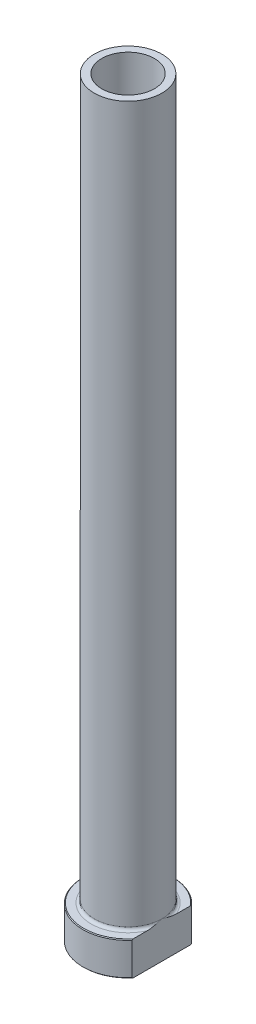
ISO-10303-21;
HEADER;
FILE_DESCRIPTION(('STEP AP214'),'2;1');
FILE_NAME('part.step','',(''),(''),'','','');
FILE_SCHEMA(('AUTOMOTIVE_DESIGN { 1 0 10303 214 1 1 1 1 }'));
ENDSEC;
DATA;
#1=APPLICATION_CONTEXT('core data for automotive mechanical design processes');
#2=APPLICATION_PROTOCOL_DEFINITION('international standard','automotive_design',2000,#1);
#3=PRODUCT_CONTEXT('',#1,'mechanical');
#4=PRODUCT('Part','Part','',(#3));
#5=PRODUCT_RELATED_PRODUCT_CATEGORY('part','',(#4));
#6=PRODUCT_DEFINITION_FORMATION('','',#4);
#7=PRODUCT_DEFINITION_CONTEXT('part definition',#1,'design');
#8=PRODUCT_DEFINITION('design','',#6,#7);
#9=PRODUCT_DEFINITION_SHAPE('','',#8);
#10=(LENGTH_UNIT() NAMED_UNIT(*) SI_UNIT(.MILLI.,.METRE.));
#11=(NAMED_UNIT(*) PLANE_ANGLE_UNIT() SI_UNIT($,.RADIAN.));
#12=(NAMED_UNIT(*) SI_UNIT($,.STERADIAN.) SOLID_ANGLE_UNIT());
#13=UNCERTAINTY_MEASURE_WITH_UNIT(LENGTH_MEASURE(1.E-05),#10,'distance_accuracy_value','');
#14=(GEOMETRIC_REPRESENTATION_CONTEXT(3) GLOBAL_UNCERTAINTY_ASSIGNED_CONTEXT((#13)) GLOBAL_UNIT_ASSIGNED_CONTEXT((#10,
#11,#12)) REPRESENTATION_CONTEXT('',''));
#15=CARTESIAN_POINT('',(0.,0.,0.));
#16=DIRECTION('',(0.,0.,1.));
#17=DIRECTION('',(1.,0.,0.));
#18=AXIS2_PLACEMENT_3D('',#15,#16,#17);
#19=CARTESIAN_POINT('',(0.,92.1876809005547,0.));
#20=DIRECTION('',(0.,1.,0.));
#21=DIRECTION('',(0.,0.,1.));
#22=AXIS2_PLACEMENT_3D('',#19,#20,#21);
#23=CYLINDRICAL_SURFACE('',#22,7.);
#24=CARTESIAN_POINT('',(0.,200.,0.));
#25=DIRECTION('',(0.,1.,0.));
#26=DIRECTION('',(0.,0.,1.));
#27=AXIS2_PLACEMENT_3D('',#24,#25,#26);
#28=CIRCLE('',#27,7.);
#29=CARTESIAN_POINT('',(0.,200.,7.));
#30=VERTEX_POINT('',#29);
#31=EDGE_CURVE('E167',#30,#30,#28,.T.);
#32=ORIENTED_EDGE('',*,*,#31,.T.);
#33=EDGE_LOOP('',(#32));
#34=FACE_BOUND('',#33,.T.);
#35=CARTESIAN_POINT('',(0.,145.,0.));
#36=DIRECTION('',(0.,1.,0.));
#37=DIRECTION('',(0.,0.,1.));
#38=AXIS2_PLACEMENT_3D('',#35,#36,#37);
#39=CIRCLE('',#38,7.);
#40=CARTESIAN_POINT('',(0.,145.,7.));
#41=VERTEX_POINT('',#40);
#42=EDGE_CURVE('E170',#41,#41,#39,.T.);
#43=ORIENTED_EDGE('',*,*,#42,.F.);
#44=EDGE_LOOP('',(#43));
#45=FACE_BOUND('',#44,.T.);
#46=ADVANCED_FACE('F32',(#34,#45),#23,.F.);
#47=CARTESIAN_POINT('',(-7.,200.,0.));
#48=DIRECTION('',(0.,1.,0.));
#49=DIRECTION('',(0.,0.,1.));
#50=AXIS2_PLACEMENT_3D('',#47,#48,#49);
#51=PLANE('',#50);
#52=CARTESIAN_POINT('',(0.,200.,0.));
#53=DIRECTION('',(0.,1.,0.));
#54=DIRECTION('',(0.,0.,1.));
#55=AXIS2_PLACEMENT_3D('',#52,#53,#54);
#56=CIRCLE('',#55,9.00000000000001);
#57=CARTESIAN_POINT('',(0.,200.,9.00000000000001));
#58=VERTEX_POINT('',#57);
#59=EDGE_CURVE('E174',#58,#58,#56,.T.);
#60=ORIENTED_EDGE('',*,*,#59,.T.);
#61=EDGE_LOOP('',(#60));
#62=FACE_BOUND('',#61,.T.);
#63=ORIENTED_EDGE('',*,*,#31,.F.);
#64=EDGE_LOOP('',(#63));
#65=FACE_BOUND('',#64,.T.);
#66=ADVANCED_FACE('F157',(#62,#65),#51,.T.);
#67=CARTESIAN_POINT('',(0.,92.1876809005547,0.));
#68=DIRECTION('',(0.,1.,0.));
#69=DIRECTION('',(0.,0.,1.));
#70=AXIS2_PLACEMENT_3D('',#67,#68,#69);
#71=CYLINDRICAL_SURFACE('',#70,9.);
#72=CARTESIAN_POINT('',(0.,9.8,0.));
#73=DIRECTION('',(0.,1.,0.));
#74=DIRECTION('',(0.,0.,1.));
#75=AXIS2_PLACEMENT_3D('',#72,#73,#74);
#76=CIRCLE('',#75,9.);
#77=CARTESIAN_POINT('',(9.,9.8,0.));
#78=VERTEX_POINT('',#77);
#79=EDGE_CURVE('E180',#78,#78,#76,.T.);
#80=ORIENTED_EDGE('',*,*,#79,.T.);
#81=EDGE_LOOP('',(#80));
#82=FACE_BOUND('',#81,.T.);
#83=ORIENTED_EDGE('',*,*,#59,.F.);
#84=EDGE_LOOP('',(#83));
#85=FACE_BOUND('',#84,.T.);
#86=ADVANCED_FACE('F162',(#82,#85),#71,.T.);
#87=CARTESIAN_POINT('',(-8.99999999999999,9.,0.));
#88=DIRECTION('',(0.,1.,0.));
#89=DIRECTION('',(0.,0.,1.));
#90=AXIS2_PLACEMENT_3D('',#87,#88,#89);
#91=PLANE('',#90);
#92=DIRECTION('',(0.,0.,1.));
#93=VECTOR('',#92,1.);
#94=CARTESIAN_POINT('',(9.,9.,0.));
#95=LINE('',#94,#93);
#96=CARTESIAN_POINT('',(9.,9.,-7.6315136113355));
#97=VERTEX_POINT('',#96);
#98=CARTESIAN_POINT('',(9.,9.,-3.87814388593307));
#99=VERTEX_POINT('',#98);
#100=EDGE_CURVE('E54',#97,#99,#95,.T.);
#101=ORIENTED_EDGE('',*,*,#100,.F.);
#102=CARTESIAN_POINT('',(0.,9.,0.));
#103=DIRECTION('',(0.,1.,0.));
#104=DIRECTION('',(0.,0.,1.));
#105=AXIS2_PLACEMENT_3D('',#102,#103,#104);
#106=CIRCLE('',#105,11.8);
#107=CARTESIAN_POINT('',(8.99999999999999,9.,7.63151361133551));
#108=VERTEX_POINT('',#107);
#109=EDGE_CURVE('E186',#97,#108,#106,.T.);
#110=ORIENTED_EDGE('',*,*,#109,.T.);
#111=CARTESIAN_POINT('',(9.,9.,3.87814388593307));
#112=VERTEX_POINT('',#111);
#113=EDGE_CURVE('E134',#112,#108,#95,.T.);
#114=ORIENTED_EDGE('',*,*,#113,.F.);
#115=CARTESIAN_POINT('',(0.,9.,0.));
#116=DIRECTION('',(0.,1.,0.));
#117=DIRECTION('',(0.,0.,1.));
#118=AXIS2_PLACEMENT_3D('',#115,#116,#117);
#119=CIRCLE('',#118,9.8);
#120=EDGE_CURVE('E183',#112,#99,#119,.F.);
#121=ORIENTED_EDGE('',*,*,#120,.T.);
#122=EDGE_LOOP('',(#101,#110,#114,#121));
#123=FACE_BOUND('',#122,.T.);
#124=ADVANCED_FACE('F197',(#123),#91,.T.);
#125=CARTESIAN_POINT('',(0.,92.1876809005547,0.));
#126=DIRECTION('',(0.,1.,0.));
#127=DIRECTION('',(0.,0.,1.));
#128=AXIS2_PLACEMENT_3D('',#125,#126,#127);
#129=CYLINDRICAL_SURFACE('',#128,12.);
#130=DIRECTION('',(0.,-1.,0.));
#131=VECTOR('',#130,1.);
#132=CARTESIAN_POINT('',(8.99999999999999,200.,7.93725393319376));
#133=LINE('',#132,#131);
#134=CARTESIAN_POINT('',(8.99999999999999,8.79999999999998,7.93725393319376));
#135=VERTEX_POINT('',#134);
#136=CARTESIAN_POINT('',(8.99999999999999,0.20000000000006,7.93725393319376));
#137=VERTEX_POINT('',#136);
#138=EDGE_CURVE('E82',#135,#137,#133,.T.);
#139=ORIENTED_EDGE('',*,*,#138,.F.);
#140=CARTESIAN_POINT('',(0.,8.79999999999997,0.));
#141=DIRECTION('',(0.,1.,0.));
#142=DIRECTION('',(0.,0.,1.));
#143=AXIS2_PLACEMENT_3D('',#140,#141,#142);
#144=CIRCLE('',#143,12.);
#145=CARTESIAN_POINT('',(9.,8.79999999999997,-7.93725393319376));
#146=VERTEX_POINT('',#145);
#147=EDGE_CURVE('E95',#135,#146,#144,.F.);
#148=ORIENTED_EDGE('',*,*,#147,.T.);
#149=DIRECTION('',(0.,-1.,0.));
#150=VECTOR('',#149,1.);
#151=CARTESIAN_POINT('',(9.,200.,-7.93725393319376));
#152=LINE('',#151,#150);
#153=CARTESIAN_POINT('',(9.,0.200000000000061,-7.93725393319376));
#154=VERTEX_POINT('',#153);
#155=EDGE_CURVE('E192',#146,#154,#152,.T.);
#156=ORIENTED_EDGE('',*,*,#155,.T.);
#157=CARTESIAN_POINT('',(0.,0.200000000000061,0.));
#158=DIRECTION('',(0.,-1.,0.));
#159=DIRECTION('',(0.,0.,-1.));
#160=AXIS2_PLACEMENT_3D('',#157,#158,#159);
#161=CIRCLE('',#160,12.);
#162=EDGE_CURVE('E98',#154,#137,#161,.F.);
#163=ORIENTED_EDGE('',*,*,#162,.T.);
#164=EDGE_LOOP('',(#139,#148,#156,#163));
#165=FACE_BOUND('',#164,.T.);
#166=ADVANCED_FACE('F190',(#165),#129,.T.);
#167=CARTESIAN_POINT('',(-12.,0.,0.));
#168=DIRECTION('',(0.,-1.,0.));
#169=DIRECTION('',(0.,0.,-1.));
#170=AXIS2_PLACEMENT_3D('',#167,#168,#169);
#171=PLANE('',#170);
#172=CARTESIAN_POINT('',(0.,0.,0.));
#173=DIRECTION('',(0.,-1.,0.));
#174=DIRECTION('',(0.,0.,-1.));
#175=AXIS2_PLACEMENT_3D('',#172,#173,#174);
#176=CIRCLE('',#175,7.74999999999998);
#177=CARTESIAN_POINT('',(0.,0.,-7.74999999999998));
#178=VERTEX_POINT('',#177);
#179=EDGE_CURVE('E40',#178,#178,#176,.F.);
#180=ORIENTED_EDGE('',*,*,#179,.T.);
#181=EDGE_LOOP('',(#180));
#182=FACE_BOUND('',#181,.T.);
#183=DIRECTION('',(0.,0.,-1.));
#184=VECTOR('',#183,1.);
#185=CARTESIAN_POINT('',(8.99999999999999,0.,7.93725393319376));
#186=LINE('',#185,#184);
#187=CARTESIAN_POINT('',(8.99999999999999,0.,7.6315136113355));
#188=VERTEX_POINT('',#187);
#189=CARTESIAN_POINT('',(9.,0.,-7.6315136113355));
#190=VERTEX_POINT('',#189);
#191=EDGE_CURVE('E47',#188,#190,#186,.T.);
#192=ORIENTED_EDGE('',*,*,#191,.F.);
#193=CARTESIAN_POINT('',(0.,0.,0.));
#194=DIRECTION('',(0.,-1.,0.));
#195=DIRECTION('',(0.,0.,-1.));
#196=AXIS2_PLACEMENT_3D('',#193,#194,#195);
#197=CIRCLE('',#196,11.8);
#198=EDGE_CURVE('E92',#188,#190,#197,.T.);
#199=ORIENTED_EDGE('',*,*,#198,.T.);
#200=EDGE_LOOP('',(#192,#199));
#201=FACE_BOUND('',#200,.T.);
#202=ADVANCED_FACE('F91',(#182,#201),#171,.T.);
#203=CARTESIAN_POINT('',(0.,92.1876809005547,0.));
#204=DIRECTION('',(0.,1.,0.));
#205=DIRECTION('',(0.,0.,1.));
#206=AXIS2_PLACEMENT_3D('',#203,#204,#205);
#207=CYLINDRICAL_SURFACE('',#206,7.25);
#208=CARTESIAN_POINT('',(0.,0.499999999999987,0.));
#209=DIRECTION('',(0.,-1.,0.));
#210=DIRECTION('',(0.,0.,-1.));
#211=AXIS2_PLACEMENT_3D('',#208,#209,#210);
#212=CIRCLE('',#211,7.25);
#213=CARTESIAN_POINT('',(0.,0.499999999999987,-7.25));
#214=VERTEX_POINT('',#213);
#215=EDGE_CURVE('E11',#214,#214,#212,.T.);
#216=ORIENTED_EDGE('',*,*,#215,.T.);
#217=EDGE_LOOP('',(#216));
#218=FACE_BOUND('',#217,.T.);
#219=CARTESIAN_POINT('',(0.,133.,0.));
#220=DIRECTION('',(0.,1.,0.));
#221=DIRECTION('',(0.,0.,1.));
#222=AXIS2_PLACEMENT_3D('',#219,#220,#221);
#223=CIRCLE('',#222,7.25000000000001);
#224=CARTESIAN_POINT('',(0.,133.,7.25000000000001));
#225=VERTEX_POINT('',#224);
#226=EDGE_CURVE('E172',#225,#225,#223,.T.);
#227=ORIENTED_EDGE('',*,*,#226,.T.);
#228=EDGE_LOOP('',(#227));
#229=FACE_BOUND('',#228,.T.);
#230=ADVANCED_FACE('F215',(#218,#229),#207,.F.);
#231=CARTESIAN_POINT('',(0.,133.,0.));
#232=DIRECTION('',(0.,-1.,0.));
#233=DIRECTION('',(0.,0.,-1.));
#234=AXIS2_PLACEMENT_3D('',#231,#232,#233);
#235=CONICAL_SURFACE('',#234,7.25000000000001,0.0208303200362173);
#236=ORIENTED_EDGE('',*,*,#42,.T.);
#237=EDGE_LOOP('',(#236));
#238=FACE_BOUND('',#237,.T.);
#239=ORIENTED_EDGE('',*,*,#226,.F.);
#240=EDGE_LOOP('',(#239));
#241=FACE_BOUND('',#240,.T.);
#242=ADVANCED_FACE('F111',(#238,#241),#235,.F.);
#243=CARTESIAN_POINT('',(0.,9.8,0.));
#244=DIRECTION('',(0.,1.,0.));
#245=DIRECTION('',(0.,0.,1.));
#246=AXIS2_PLACEMENT_3D('',#243,#244,#245);
#247=TOROIDAL_SURFACE('',#246,9.8,0.8);
#248=ORIENTED_EDGE('',*,*,#120,.F.);
#249=CARTESIAN_POINT('',(9.,9.8,0.));
#250=CARTESIAN_POINT('',(9.,9.80000101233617,-6.46837226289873E-11));
#251=CARTESIAN_POINT('',(9.,9.80000202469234,3.1733241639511E-07));
#252=CARTESIAN_POINT('',(9.,9.80000393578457,1.24154711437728E-06));
#253=CARTESIAN_POINT('',(9.,9.80000482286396,1.86583013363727E-06));
#254=CARTESIAN_POINT('',(9.,9.80000663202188,3.35641272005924E-06));
#255=CARTESIAN_POINT('',(9.,9.80000753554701,4.245673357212E-06));
#256=CARTESIAN_POINT('',(9.,9.80000918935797,6.11612133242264E-06));
#257=CARTESIAN_POINT('',(9.,9.80000994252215,7.09491962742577E-06));
#258=CARTESIAN_POINT('',(9.,9.80001263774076,1.07802695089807E-05));
#259=CARTESIAN_POINT('',(9.,9.80001442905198,1.36008580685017E-05));
#260=CARTESIAN_POINT('',(9.,9.80001746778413,1.9272252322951E-05));
#261=CARTESIAN_POINT('',(9.,9.80001874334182,2.2108720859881E-05));
#262=CARTESIAN_POINT('',(9.,9.80002390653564,3.37975021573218E-05));
#263=CARTESIAN_POINT('',(9.,9.80002763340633,4.27293144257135E-05));
#264=CARTESIAN_POINT('',(9.,9.80003330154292,5.98324777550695E-05));
#265=CARTESIAN_POINT('',(9.,9.80003541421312,6.79472930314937E-05));
#266=CARTESIAN_POINT('',(9.,9.80005049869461,0.000127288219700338));
#267=CARTESIAN_POINT('',(9.,9.80006163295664,0.000178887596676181));
#268=CARTESIAN_POINT('',(8.99999999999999,9.80011034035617,0.000381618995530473));
#269=CARTESIAN_POINT('',(9.,9.80015710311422,0.000530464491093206));
#270=CARTESIAN_POINT('',(9.,9.80033804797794,0.0011172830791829));
#271=CARTESIAN_POINT('',(9.,9.80046603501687,0.00155660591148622));
#272=CARTESIAN_POINT('',(8.99999999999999,9.80097635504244,0.003294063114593));
#273=CARTESIAN_POINT('',(8.99999999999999,9.80136631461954,0.00459050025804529));
#274=CARTESIAN_POINT('',(9.,9.80298403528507,0.00998416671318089));
#275=CARTESIAN_POINT('',(9.,9.80420236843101,0.0140834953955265));
#276=CARTESIAN_POINT('',(8.99999999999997,9.82648661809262,0.089042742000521));
#277=CARTESIAN_POINT('',(8.99999999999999,9.84764626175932,0.159882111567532));
#278=CARTESIAN_POINT('',(9.,9.8889590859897,0.298764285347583));
#279=CARTESIAN_POINT('',(9.,9.90911860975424,0.366805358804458));
#280=CARTESIAN_POINT('',(8.99999999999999,9.95179311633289,0.511524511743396));
#281=CARTESIAN_POINT('',(9.,9.97428452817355,0.588209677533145));
#282=CARTESIAN_POINT('',(9.,10.0191408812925,0.742532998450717));
#283=CARTESIAN_POINT('',(9.,10.0415017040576,0.820172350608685));
#284=CARTESIAN_POINT('',(9.,10.079411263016,0.953448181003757));
#285=CARTESIAN_POINT('',(9.,10.0950851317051,1.00904901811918));
#286=CARTESIAN_POINT('',(9.,10.1260784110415,1.12019530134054));
#287=CARTESIAN_POINT('',(9.,10.1413986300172,1.17574052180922));
#288=CARTESIAN_POINT('',(9.,10.1860703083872,1.33980716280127));
#289=CARTESIAN_POINT('',(9.,10.2149083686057,1.44846861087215));
#290=CARTESIAN_POINT('',(9.,10.2856369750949,1.72417832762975));
#291=CARTESIAN_POINT('',(9.,10.3263124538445,1.89154391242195));
#292=CARTESIAN_POINT('',(9.,10.4020454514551,2.22904779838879));
#293=CARTESIAN_POINT('',(9.,10.4370523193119,2.39919757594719));
#294=CARTESIAN_POINT('',(9.,10.5014391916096,2.75494052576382));
#295=CARTESIAN_POINT('',(9.,10.5301301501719,2.94066439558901));
#296=CARTESIAN_POINT('',(9.,10.5633122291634,3.22016202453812));
#297=CARTESIAN_POINT('',(9.,10.5727244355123,3.31335338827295));
#298=CARTESIAN_POINT('',(9.,10.5877042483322,3.50003892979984));
#299=CARTESIAN_POINT('',(9.,10.5932725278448,3.59353305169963));
#300=CARTESIAN_POINT('',(9.,10.5997812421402,3.77831079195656));
#301=CARTESIAN_POINT('',(9.,10.6008358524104,3.8695901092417));
#302=CARTESIAN_POINT('',(9.,10.5977997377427,4.05215299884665));
#303=CARTESIAN_POINT('',(8.99999999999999,10.5937049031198,4.14343651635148));
#304=CARTESIAN_POINT('',(8.99999999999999,10.5793848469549,4.32415905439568));
#305=CARTESIAN_POINT('',(8.99999999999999,10.5692536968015,4.41360502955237));
#306=CARTESIAN_POINT('',(8.99999999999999,10.5415393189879,4.59125765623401));
#307=CARTESIAN_POINT('',(8.99999999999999,10.5239649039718,4.67946564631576));
#308=CARTESIAN_POINT('',(8.99999999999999,10.4790565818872,4.85471882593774));
#309=CARTESIAN_POINT('',(8.99999999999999,10.4516029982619,4.94173554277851));
#310=CARTESIAN_POINT('',(8.99999999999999,10.4007972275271,5.06830195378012));
#311=CARTESIAN_POINT('',(8.99999999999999,10.3822808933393,5.1097917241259));
#312=CARTESIAN_POINT('',(8.99999999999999,10.3414775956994,5.19085457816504));
#313=CARTESIAN_POINT('',(8.99999999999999,10.3191952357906,5.23042992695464));
#314=CARTESIAN_POINT('',(8.99999999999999,10.2750362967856,5.29920261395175));
#315=CARTESIAN_POINT('',(8.99999999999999,10.2539514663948,5.32890420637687));
#316=CARTESIAN_POINT('',(8.99999999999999,10.2085010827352,5.38577147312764));
#317=CARTESIAN_POINT('',(8.99999999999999,10.1841327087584,5.41293493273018));
#318=CARTESIAN_POINT('',(8.99999999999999,10.1314615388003,5.46389233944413));
#319=CARTESIAN_POINT('',(8.99999999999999,10.1031152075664,5.48764214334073));
#320=CARTESIAN_POINT('',(8.99999999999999,10.04261248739,5.52966859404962));
#321=CARTESIAN_POINT('',(8.99999999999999,10.0104678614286,5.54796155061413));
#322=CARTESIAN_POINT('',(8.99999999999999,9.95377518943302,5.57238639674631));
#323=CARTESIAN_POINT('',(8.99999999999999,9.93009823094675,5.58053697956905));
#324=CARTESIAN_POINT('',(8.99999999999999,9.88171464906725,5.59278453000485));
#325=CARTESIAN_POINT('',(8.99999999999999,9.85700894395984,5.59688503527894));
#326=CARTESIAN_POINT('',(8.99999999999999,9.80717489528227,5.60067699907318));
#327=CARTESIAN_POINT('',(8.99999999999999,9.78204544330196,5.60035415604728));
#328=CARTESIAN_POINT('',(8.99999999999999,9.73223420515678,5.59529565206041));
#329=CARTESIAN_POINT('',(8.99999999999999,9.7075525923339,5.5905583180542));
#330=CARTESIAN_POINT('',(8.99999999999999,9.66020362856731,5.57733425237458));
#331=CARTESIAN_POINT('',(8.99999999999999,9.63749568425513,5.56898983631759));
#332=CARTESIAN_POINT('',(8.99999999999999,9.5935151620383,5.54915687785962));
#333=CARTESIAN_POINT('',(8.99999999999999,9.57224307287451,5.5376672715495));
#334=CARTESIAN_POINT('',(8.99999999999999,9.51928150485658,5.50462580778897));
#335=CARTESIAN_POINT('',(8.99999999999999,9.48880776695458,5.4811266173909));
#336=CARTESIAN_POINT('',(8.99999999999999,9.43189052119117,5.42965338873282));
#337=CARTESIAN_POINT('',(8.99999999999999,9.40546009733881,5.40166539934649));
#338=CARTESIAN_POINT('',(8.99999999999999,9.34005551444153,5.32319042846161));
#339=CARTESIAN_POINT('',(8.99999999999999,9.3043047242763,5.27003866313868));
#340=CARTESIAN_POINT('',(8.99999999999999,9.24095813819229,5.15926391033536));
#341=CARTESIAN_POINT('',(8.99999999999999,9.21336826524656,5.10163771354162));
#342=CARTESIAN_POINT('',(8.99999999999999,9.16551403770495,4.98579619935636));
#343=CARTESIAN_POINT('',(8.99999999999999,9.14502939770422,4.92767012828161));
#344=CARTESIAN_POINT('',(8.99999999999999,9.10900516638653,4.80987690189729));
#345=CARTESIAN_POINT('',(8.99999999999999,9.09347054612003,4.75020826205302));
#346=CARTESIAN_POINT('',(8.99999999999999,9.06639912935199,4.6292635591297));
#347=CARTESIAN_POINT('',(8.99999999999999,9.05491059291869,4.56797688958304));
#348=CARTESIAN_POINT('',(8.99999999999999,9.0355498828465,4.44488746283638));
#349=CARTESIAN_POINT('',(8.99999999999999,9.02767548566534,4.38308504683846));
#350=CARTESIAN_POINT('',(8.99999999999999,9.01237706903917,4.23320098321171));
#351=CARTESIAN_POINT('',(8.99999999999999,9.00652460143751,4.14495990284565));
#352=CARTESIAN_POINT('',(8.99999999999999,8.99996624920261,3.96827125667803));
#353=CARTESIAN_POINT('',(9.,8.99926276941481,3.87982361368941));
#354=CARTESIAN_POINT('',(9.,9.00218728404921,3.70272096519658));
#355=CARTESIAN_POINT('',(9.,9.00582939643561,3.61406622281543));
#356=CARTESIAN_POINT('',(9.,9.01681466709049,3.43698088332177));
#357=CARTESIAN_POINT('',(9.,9.02415848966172,3.34855032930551));
#358=CARTESIAN_POINT('',(9.,9.04989749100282,3.09391807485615));
#359=CARTESIAN_POINT('',(9.,9.0723219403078,2.92812217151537));
#360=CARTESIAN_POINT('',(9.,9.12539895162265,2.59921508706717));
#361=CARTESIAN_POINT('',(9.,9.15598725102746,2.43609307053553));
#362=CARTESIAN_POINT('',(9.,9.22330285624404,2.11182788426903));
#363=CARTESIAN_POINT('',(9.,9.26000471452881,1.95067936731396));
#364=CARTESIAN_POINT('',(9.,9.31897632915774,1.70786584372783));
#365=CARTESIAN_POINT('',(9.,9.33955107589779,1.62578051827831));
#366=CARTESIAN_POINT('',(9.,9.38177259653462,1.46165638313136));
#367=CARTESIAN_POINT('',(9.,9.4034220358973,1.37961825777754));
#368=CARTESIAN_POINT('',(9.,9.45602430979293,1.18435079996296));
#369=CARTESIAN_POINT('',(9.,9.48736095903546,1.07122519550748));
#370=CARTESIAN_POINT('',(9.,9.55083956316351,0.846545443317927));
#371=CARTESIAN_POINT('',(9.,9.58296886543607,0.734987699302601));
#372=CARTESIAN_POINT('',(8.99999999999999,9.64431039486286,0.524609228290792));
#373=CARTESIAN_POINT('',(8.99999999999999,9.67344475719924,0.425765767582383));
#374=CARTESIAN_POINT('',(9.,9.71808680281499,0.275077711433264));
#375=CARTESIAN_POINT('',(9.,9.73349584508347,0.223203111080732));
#376=CARTESIAN_POINT('',(8.99999999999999,9.76415269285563,0.120285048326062));
#377=CARTESIAN_POINT('',(8.99999999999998,9.7793992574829,0.0692412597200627));
#378=CARTESIAN_POINT('',(9.,9.79579831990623,0.0140813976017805));
#379=CARTESIAN_POINT('',(9.,9.7970172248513,0.00997994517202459));
#380=CARTESIAN_POINT('',(8.99999999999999,9.79863508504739,0.00458578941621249));
#381=CARTESIAN_POINT('',(8.99999999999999,9.79902455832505,0.00329097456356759));
#382=CARTESIAN_POINT('',(9.,9.79953428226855,0.00155554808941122));
#383=CARTESIAN_POINT('',(9.,9.79966215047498,0.00111663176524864));
#384=CARTESIAN_POINT('',(9.,9.79984295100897,0.000530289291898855));
#385=CARTESIAN_POINT('',(8.99999999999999,9.79988969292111,0.000381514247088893));
#386=CARTESIAN_POINT('',(9.,9.79993838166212,0.000178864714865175));
#387=CARTESIAN_POINT('',(9.,9.79994951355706,0.000127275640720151));
#388=CARTESIAN_POINT('',(9.,9.79996459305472,6.79451326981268E-05));
#389=CARTESIAN_POINT('',(9.,9.79996670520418,5.98309285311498E-05));
#390=CARTESIAN_POINT('',(9.,9.79997237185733,4.27289821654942E-05));
#391=CARTESIAN_POINT('',(9.,9.79997609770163,3.37977439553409E-05));
#392=CARTESIAN_POINT('',(9.,9.79998125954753,2.21095447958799E-05));
#393=CARTESIAN_POINT('',(9.,9.79998253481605,1.92731218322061E-05));
#394=CARTESIAN_POINT('',(9.,9.79998557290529,1.36017677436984E-05));
#395=CARTESIAN_POINT('',(9.,9.79998736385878,1.07811687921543E-05));
#396=CARTESIAN_POINT('',(9.,9.79999005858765,7.09574455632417E-06));
#397=CARTESIAN_POINT('',(9.,9.79999081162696,6.11691132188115E-06));
#398=CARTESIAN_POINT('',(9.,9.79999246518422,4.24637095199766E-06));
#399=CARTESIAN_POINT('',(9.,9.79999336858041,3.35705227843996E-06));
#400=CARTESIAN_POINT('',(9.,9.79999517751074,1.86633170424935E-06));
#401=CARTESIAN_POINT('',(9.,9.79999606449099,1.24197318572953E-06));
#402=CARTESIAN_POINT('',(9.,9.79999797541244,3.1757083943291E-07));
#403=CARTESIAN_POINT('',(9.,9.79999898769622,6.46855868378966E-11));
#404=CARTESIAN_POINT('',(9.,9.8,0.));
#405=B_SPLINE_CURVE_WITH_KNOTS('',3,(#249,#250,#251,#252,#253,#254,#255,#256,#257,#258,#259,
#260,#261,#262,#263,#264,#265,#266,#267,#268,#269,#270,#271,#272,#273,#274,#275,#276,#277,#278,
#279,#280,#281,#282,#283,#284,#285,#286,#287,#288,#289,#290,#291,#292,#293,#294,#295,#296,#297,
#298,#299,#300,#301,#302,#303,#304,#305,#306,#307,#308,#309,#310,#311,#312,#313,#314,#315,#316,
#317,#318,#319,#320,#321,#322,#323,#324,#325,#326,#327,#328,#329,#330,#331,#332,#333,#334,#335,
#336,#337,#338,#339,#340,#341,#342,#343,#344,#345,#346,#347,#348,#349,#350,#351,#352,#353,#354,
#355,#356,#357,#358,#359,#360,#361,#362,#363,#364,#365,#366,#367,#368,#369,#370,#371,#372,#373,
#374,#375,#376,#377,#378,#379,#380,#381,#382,#383,#384,#385,#386,#387,#388,#389,#390,#391,#392,
#393,#394,#395,#396,#397,#398,#399,#400,#401,#402,#403,#404),.UNSPECIFIED.,.T.,.F.,(4,2,2,2,2,2,
2,2,2,2,2,2,2,2,2,2,2,2,2,2,2,2,2,2,2,2,2,2,2,2,2,2,2,2,2,2,2,2,2,2,2,2,2,2,2,2,2,2,2,2,2,2,2,2,
2,2,2,2,2,2,2,2,2,2,2,2,2,2,2,2,2,2,2,2,2,2,2,4),(0.,3.0477175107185E-06,6.29346410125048E-06,
1.0076989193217E-05,1.377912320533E-05,2.37619394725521E-05,3.30844939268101E-05,
6.20552070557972E-05,8.71785192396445E-05,0.000245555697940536,0.000713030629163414,
0.00208637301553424,0.00614710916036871,0.0189775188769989,0.240764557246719,0.453660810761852,
0.693405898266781,0.935790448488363,1.10909318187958,1.28194996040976,1.619210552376,
2.13583880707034,2.65685508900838,3.22023907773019,3.5011731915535,3.78205810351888,
4.05579427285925,4.32974904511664,4.5995421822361,4.8690167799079,5.14187221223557,
5.27802968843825,5.41402191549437,5.52311134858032,5.63229509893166,5.74278355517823,
5.85293838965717,5.92775570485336,6.00250761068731,6.07750126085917,6.15252334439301,
6.2248226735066,6.29714648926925,6.4119295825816,6.52707659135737,6.7181646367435,
6.90939103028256,7.09400621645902,7.27880622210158,7.46574121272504,7.65256103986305,
7.91766914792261,8.18290106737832,8.4489970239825,8.71514075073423,9.21672782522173,
9.71447745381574,10.2102047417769,10.4640739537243,10.7186077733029,11.0707555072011,
11.4190290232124,11.7281703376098,11.8905163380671,12.0503265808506,12.0631635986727,
12.0672192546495,12.068591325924,12.0690585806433,12.0692169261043,12.0692420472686,
12.0692710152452,12.0692803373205,12.0692903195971,12.0692940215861,12.0692978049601,
12.0693010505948,12.0693040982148),.UNSPECIFIED.);
#406=EDGE_CURVE('E126',#112,#78,#405,.T.);
#407=ORIENTED_EDGE('',*,*,#406,.T.);
#408=ORIENTED_EDGE('',*,*,#79,.F.);
#409=CARTESIAN_POINT('',(9.,9.8,0.));
#410=CARTESIAN_POINT('',(9.,9.79999898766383,6.46880328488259E-11));
#411=CARTESIAN_POINT('',(9.,9.79999797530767,-3.17332412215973E-07));
#412=CARTESIAN_POINT('',(9.,9.79999606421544,-1.24154711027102E-06));
#413=CARTESIAN_POINT('',(9.,9.79999517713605,-1.86583012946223E-06));
#414=CARTESIAN_POINT('',(9.,9.79999336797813,-3.35641271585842E-06));
#415=CARTESIAN_POINT('',(9.,9.799992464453,-4.24567335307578E-06));
#416=CARTESIAN_POINT('',(9.,9.79999081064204,-6.11612132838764E-06));
#417=CARTESIAN_POINT('',(9.,9.79999005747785,-7.09491962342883E-06));
#418=CARTESIAN_POINT('',(9.,9.79998736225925,-1.07802695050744E-05));
#419=CARTESIAN_POINT('',(9.,9.79998557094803,-1.36008580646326E-05));
#420=CARTESIAN_POINT('',(9.,9.79998253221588,-1.92722523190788E-05));
#421=CARTESIAN_POINT('',(9.,9.79998125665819,-2.21087208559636E-05));
#422=CARTESIAN_POINT('',(9.,9.79997609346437,-3.37975021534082E-05));
#423=CARTESIAN_POINT('',(9.,9.79997236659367,-4.27293144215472E-05));
#424=CARTESIAN_POINT('',(9.,9.79996669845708,-5.98324777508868E-05));
#425=CARTESIAN_POINT('',(9.,9.79996458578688,-6.79472930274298E-05));
#426=CARTESIAN_POINT('',(9.,9.7999495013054,-0.000127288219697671));
#427=CARTESIAN_POINT('',(9.,9.79993836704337,-0.000178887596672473));
#428=CARTESIAN_POINT('',(8.99999999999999,9.79988965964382,-0.00038161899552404));
#429=CARTESIAN_POINT('',(9.,9.79984289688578,-0.000530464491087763));
#430=CARTESIAN_POINT('',(9.,9.79966195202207,-0.00111728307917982));
#431=CARTESIAN_POINT('',(9.,9.79953396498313,-0.00155660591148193));
#432=CARTESIAN_POINT('',(8.99999999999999,9.79902364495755,-0.00329406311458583));
#433=CARTESIAN_POINT('',(8.99999999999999,9.79863368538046,-0.00459050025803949));
#434=CARTESIAN_POINT('',(9.,9.79701596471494,-0.00998416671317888));
#435=CARTESIAN_POINT('',(9.,9.79579763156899,-0.0140834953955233));
#436=CARTESIAN_POINT('',(8.99999999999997,9.77351338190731,-0.0890427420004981));
#437=CARTESIAN_POINT('',(8.99999999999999,9.75235373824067,-0.159882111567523));
#438=CARTESIAN_POINT('',(9.,9.71104091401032,-0.298764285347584));
#439=CARTESIAN_POINT('',(9.,9.69088139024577,-0.366805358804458));
#440=CARTESIAN_POINT('',(8.99999999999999,9.64820688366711,-0.511524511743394));
#441=CARTESIAN_POINT('',(9.,9.62571547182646,-0.588209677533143));
#442=CARTESIAN_POINT('',(9.,9.5808591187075,-0.742532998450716));
#443=CARTESIAN_POINT('',(9.,9.55849829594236,-0.820172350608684));
#444=CARTESIAN_POINT('',(9.,9.52058873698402,-0.953448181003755));
#445=CARTESIAN_POINT('',(9.,9.50491486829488,-1.00904901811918));
#446=CARTESIAN_POINT('',(9.,9.47392158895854,-1.12019530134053));
#447=CARTESIAN_POINT('',(9.,9.45860136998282,-1.17574052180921));
#448=CARTESIAN_POINT('',(9.,9.41392969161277,-1.33980716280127));
#449=CARTESIAN_POINT('',(9.,9.38509163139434,-1.44846861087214));
#450=CARTESIAN_POINT('',(9.,9.31436302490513,-1.72417832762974));
#451=CARTESIAN_POINT('',(9.,9.27368754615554,-1.89154391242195));
#452=CARTESIAN_POINT('',(9.,9.19795454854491,-2.22904779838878));
#453=CARTESIAN_POINT('',(9.,9.16294768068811,-2.39919757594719));
#454=CARTESIAN_POINT('',(9.,9.09856080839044,-2.75494052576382));
#455=CARTESIAN_POINT('',(9.,9.06986984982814,-2.940664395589));
#456=CARTESIAN_POINT('',(9.,9.03668777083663,-3.22016202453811));
#457=CARTESIAN_POINT('',(9.,9.0272755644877,-3.31335338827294));
#458=CARTESIAN_POINT('',(9.,9.01229575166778,-3.50003892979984));
#459=CARTESIAN_POINT('',(9.,9.00672747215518,-3.59353305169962));
#460=CARTESIAN_POINT('',(9.,9.00021875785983,-3.77831079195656));
#461=CARTESIAN_POINT('',(9.,8.99916414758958,-3.8695901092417));
#462=CARTESIAN_POINT('',(9.,9.00220026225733,-4.05215299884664));
#463=CARTESIAN_POINT('',(9.,9.00629509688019,-4.14343651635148));
#464=CARTESIAN_POINT('',(9.,9.02061515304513,-4.32415905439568));
#465=CARTESIAN_POINT('',(9.,9.03074630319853,-4.41360502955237));
#466=CARTESIAN_POINT('',(9.,9.05846068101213,-4.59125765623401));
#467=CARTESIAN_POINT('',(9.,9.0760350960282,-4.67946564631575));
#468=CARTESIAN_POINT('',(9.,9.12094341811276,-4.85471882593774));
#469=CARTESIAN_POINT('',(9.,9.14839700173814,-4.9417355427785));
#470=CARTESIAN_POINT('',(9.,9.19920277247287,-5.06830195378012));
#471=CARTESIAN_POINT('',(9.,9.2177191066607,-5.1097917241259));
#472=CARTESIAN_POINT('',(9.,9.25852240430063,-5.19085457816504));
#473=CARTESIAN_POINT('',(9.,9.28080476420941,-5.23042992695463));
#474=CARTESIAN_POINT('',(9.,9.32496370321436,-5.29920261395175));
#475=CARTESIAN_POINT('',(9.,9.34604853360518,-5.32890420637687));
#476=CARTESIAN_POINT('',(9.,9.39149891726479,-5.38577147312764));
#477=CARTESIAN_POINT('',(9.,9.41586729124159,-5.41293493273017));
#478=CARTESIAN_POINT('',(9.,9.46853846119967,-5.46389233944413));
#479=CARTESIAN_POINT('',(9.,9.49688479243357,-5.48764214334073));
#480=CARTESIAN_POINT('',(9.,9.55738751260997,-5.52966859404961));
#481=CARTESIAN_POINT('',(9.,9.58953213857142,-5.54796155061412));
#482=CARTESIAN_POINT('',(9.,9.64622481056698,-5.5723863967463));
#483=CARTESIAN_POINT('',(9.,9.66990176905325,-5.58053697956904));
#484=CARTESIAN_POINT('',(9.,9.71828535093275,-5.59278453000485));
#485=CARTESIAN_POINT('',(9.,9.74299105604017,-5.59688503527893));
#486=CARTESIAN_POINT('',(9.,9.79282510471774,-5.60067699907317));
#487=CARTESIAN_POINT('',(9.,9.81795455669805,-5.60035415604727));
#488=CARTESIAN_POINT('',(9.,9.86776579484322,-5.59529565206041));
#489=CARTESIAN_POINT('',(9.,9.89244740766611,-5.5905583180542));
#490=CARTESIAN_POINT('',(9.,9.93979637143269,-5.57733425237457));
#491=CARTESIAN_POINT('',(9.,9.96250431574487,-5.56898983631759));
#492=CARTESIAN_POINT('',(9.,10.0064848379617,-5.54915687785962));
#493=CARTESIAN_POINT('',(9.,10.0277569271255,-5.5376672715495));
#494=CARTESIAN_POINT('',(9.,10.0807184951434,-5.50462580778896));
#495=CARTESIAN_POINT('',(9.,10.1111922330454,-5.4811266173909));
#496=CARTESIAN_POINT('',(9.,10.1681094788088,-5.42965338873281));
#497=CARTESIAN_POINT('',(9.,10.1945399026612,-5.40166539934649));
#498=CARTESIAN_POINT('',(9.,10.2599444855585,-5.3231904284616));
#499=CARTESIAN_POINT('',(9.,10.2956952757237,-5.27003866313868));
#500=CARTESIAN_POINT('',(9.,10.3590418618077,-5.15926391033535));
#501=CARTESIAN_POINT('',(9.,10.3866317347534,-5.10163771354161));
#502=CARTESIAN_POINT('',(9.,10.4344859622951,-4.98579619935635));
#503=CARTESIAN_POINT('',(9.,10.4549706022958,-4.9276701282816));
#504=CARTESIAN_POINT('',(9.,10.4909948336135,-4.80987690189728));
#505=CARTESIAN_POINT('',(9.,10.50652945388,-4.75020826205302));
#506=CARTESIAN_POINT('',(9.,10.533600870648,-4.62926355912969));
#507=CARTESIAN_POINT('',(9.,10.5450894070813,-4.56797688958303));
#508=CARTESIAN_POINT('',(9.,10.5644501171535,-4.44488746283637));
#509=CARTESIAN_POINT('',(9.,10.5723245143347,-4.38308504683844));
#510=CARTESIAN_POINT('',(9.,10.5876229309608,-4.2332009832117));
#511=CARTESIAN_POINT('',(9.,10.5934753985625,-4.14495990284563));
#512=CARTESIAN_POINT('',(9.,10.6000337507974,-3.96827125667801));
#513=CARTESIAN_POINT('',(9.,10.6007372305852,-3.8798236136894));
#514=CARTESIAN_POINT('',(9.,10.5978127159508,-3.70272096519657));
#515=CARTESIAN_POINT('',(9.,10.5941706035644,-3.61406622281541));
#516=CARTESIAN_POINT('',(9.,10.5831853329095,-3.43698088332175));
#517=CARTESIAN_POINT('',(9.,10.5758415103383,-3.3485503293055));
#518=CARTESIAN_POINT('',(9.,10.5501025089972,-3.09391807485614));
#519=CARTESIAN_POINT('',(9.,10.5276780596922,-2.92812217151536));
#520=CARTESIAN_POINT('',(9.,10.4746010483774,-2.59921508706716));
#521=CARTESIAN_POINT('',(9.,10.4440127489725,-2.43609307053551));
#522=CARTESIAN_POINT('',(9.,10.376697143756,-2.11182788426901));
#523=CARTESIAN_POINT('',(9.,10.3399952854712,-1.95067936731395));
#524=CARTESIAN_POINT('',(9.,10.2810236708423,-1.70786584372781));
#525=CARTESIAN_POINT('',(9.,10.2604489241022,-1.62578051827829));
#526=CARTESIAN_POINT('',(9.,10.2182274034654,-1.46165638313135));
#527=CARTESIAN_POINT('',(9.,10.1965779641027,-1.37961825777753));
#528=CARTESIAN_POINT('',(9.,10.1439756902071,-1.18435079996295));
#529=CARTESIAN_POINT('',(9.,10.1126390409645,-1.07122519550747));
#530=CARTESIAN_POINT('',(9.,10.0491604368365,-0.846545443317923));
#531=CARTESIAN_POINT('',(9.,10.0170311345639,-0.734987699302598));
#532=CARTESIAN_POINT('',(8.99999999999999,9.95568960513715,-0.524609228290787));
#533=CARTESIAN_POINT('',(8.99999999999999,9.92655524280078,-0.425765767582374));
#534=CARTESIAN_POINT('',(9.,9.88191319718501,-0.275077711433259));
#535=CARTESIAN_POINT('',(9.,9.86650415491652,-0.223203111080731));
#536=CARTESIAN_POINT('',(8.99999999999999,9.83584730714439,-0.120285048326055));
#537=CARTESIAN_POINT('',(8.99999999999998,9.82060074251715,-0.0692412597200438));
#538=CARTESIAN_POINT('',(9.,9.80420168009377,-0.0140813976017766));
#539=CARTESIAN_POINT('',(9.,9.8029827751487,-0.00997994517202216));
#540=CARTESIAN_POINT('',(8.99999999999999,9.80136491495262,-0.00458578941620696));
#541=CARTESIAN_POINT('',(8.99999999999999,9.80097544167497,-0.00329097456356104));
#542=CARTESIAN_POINT('',(9.,9.80046571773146,-0.00155554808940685));
#543=CARTESIAN_POINT('',(9.,9.80033784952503,-0.00111663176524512));
#544=CARTESIAN_POINT('',(9.,9.80015704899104,-0.000530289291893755));
#545=CARTESIAN_POINT('',(8.99999999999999,9.8001103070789,-0.000381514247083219));
#546=CARTESIAN_POINT('',(9.,9.80006161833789,-0.000178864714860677));
#547=CARTESIAN_POINT('',(9.,9.80005048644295,-0.000127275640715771));
#548=CARTESIAN_POINT('',(9.,9.80003540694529,-6.79451326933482E-05));
#549=CARTESIAN_POINT('',(9.,9.80003329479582,-5.98309285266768E-05));
#550=CARTESIAN_POINT('',(9.,9.80002762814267,-4.27289821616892E-05));
#551=CARTESIAN_POINT('',(9.,9.80002390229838,-3.37977439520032E-05));
#552=CARTESIAN_POINT('',(9.,9.80001874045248,-2.2109544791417E-05));
#553=CARTESIAN_POINT('',(9.,9.80001746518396,-1.92731218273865E-05));
#554=CARTESIAN_POINT('',(9.,9.80001442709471,-1.36017677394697E-05));
#555=CARTESIAN_POINT('',(9.,9.80001263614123,-1.078116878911E-05));
#556=CARTESIAN_POINT('',(9.,9.80000994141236,-7.09574455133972E-06));
#557=CARTESIAN_POINT('',(9.,9.80000918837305,-6.11691131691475E-06));
#558=CARTESIAN_POINT('',(9.,9.80000753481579,-4.24637094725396E-06));
#559=CARTESIAN_POINT('',(9.,9.8000066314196,-3.3570522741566E-06));
#560=CARTESIAN_POINT('',(9.,9.80000482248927,-1.86633170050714E-06));
#561=CARTESIAN_POINT('',(9.,9.80000393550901,-1.24197318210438E-06));
#562=CARTESIAN_POINT('',(9.,9.80000202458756,-3.17570836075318E-07));
#563=CARTESIAN_POINT('',(9.,9.80000101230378,-6.46820290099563E-11));
#564=CARTESIAN_POINT('',(9.,9.8,0.));
#565=B_SPLINE_CURVE_WITH_KNOTS('',3,(#409,#410,#411,#412,#413,#414,#415,#416,#417,#418,#419,
#420,#421,#422,#423,#424,#425,#426,#427,#428,#429,#430,#431,#432,#433,#434,#435,#436,#437,#438,
#439,#440,#441,#442,#443,#444,#445,#446,#447,#448,#449,#450,#451,#452,#453,#454,#455,#456,#457,
#458,#459,#460,#461,#462,#463,#464,#465,#466,#467,#468,#469,#470,#471,#472,#473,#474,#475,#476,
#477,#478,#479,#480,#481,#482,#483,#484,#485,#486,#487,#488,#489,#490,#491,#492,#493,#494,#495,
#496,#497,#498,#499,#500,#501,#502,#503,#504,#505,#506,#507,#508,#509,#510,#511,#512,#513,#514,
#515,#516,#517,#518,#519,#520,#521,#522,#523,#524,#525,#526,#527,#528,#529,#530,#531,#532,#533,
#534,#535,#536,#537,#538,#539,#540,#541,#542,#543,#544,#545,#546,#547,#548,#549,#550,#551,#552,
#553,#554,#555,#556,#557,#558,#559,#560,#561,#562,#563,#564),.UNSPECIFIED.,.T.,.F.,(4,2,2,2,2,2,
2,2,2,2,2,2,2,2,2,2,2,2,2,2,2,2,2,2,2,2,2,2,2,2,2,2,2,2,2,2,2,2,2,2,2,2,2,2,2,2,2,2,2,2,2,2,2,2,
2,2,2,2,2,2,2,2,2,2,2,2,2,2,2,2,2,2,2,2,2,2,2,4),(0.,3.04771751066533E-06,6.29346410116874E-06,
1.00769891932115E-05,1.37791232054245E-05,2.37619394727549E-05,3.30844939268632E-05,
6.20552070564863E-05,8.71785192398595E-05,0.000245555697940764,0.000713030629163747,
0.00208637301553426,0.00614710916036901,0.0189775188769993,0.24076455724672,0.453660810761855,
0.693405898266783,0.935790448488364,1.10909318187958,1.28194996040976,1.619210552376,
2.13583880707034,2.65685508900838,3.22023907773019,3.5011731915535,3.78205810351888,
4.05579427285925,4.32974904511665,4.5995421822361,4.86901677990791,5.14187221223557,
5.27802968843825,5.41402191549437,5.52311134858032,5.63229509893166,5.74278355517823,
5.85293838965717,5.92775570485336,6.00250761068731,6.07750126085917,6.15252334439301,
6.2248226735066,6.29714648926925,6.4119295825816,6.52707659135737,6.7181646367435,
6.90939103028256,7.09400621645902,7.27880622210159,7.46574121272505,7.65256103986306,
7.91766914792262,8.18290106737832,8.44899702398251,8.71514075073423,9.21672782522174,
9.71447745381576,10.2102047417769,10.4640739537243,10.718607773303,11.0707555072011,
11.4190290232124,11.7281703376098,11.890516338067,12.0503265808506,12.0631635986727,
12.0672192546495,12.068591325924,12.0690585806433,12.0692169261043,12.0692420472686,
12.0692710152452,12.0692803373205,12.0692903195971,12.0692940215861,12.0692978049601,
12.0693010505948,12.0693040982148),.UNSPECIFIED.);
#566=EDGE_CURVE('E135',#78,#99,#565,.T.);
#567=ORIENTED_EDGE('',*,*,#566,.T.);
#568=EDGE_LOOP('',(#248,#407,#408,#567));
#569=FACE_BOUND('',#568,.T.);
#570=ADVANCED_FACE('F141',(#569),#247,.F.);
#571=CARTESIAN_POINT('',(0.,9.00000000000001,0.));
#572=DIRECTION('',(0.,-1.,0.));
#573=DIRECTION('',(0.,0.,-1.));
#574=AXIS2_PLACEMENT_3D('',#571,#572,#573);
#575=CONICAL_SURFACE('',#574,11.7999999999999,0.785398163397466);
#576=CARTESIAN_POINT('',(9.,1.15430366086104,-17.4629145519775));
#577=CARTESIAN_POINT('',(9.,1.38083160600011,-17.2080654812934));
#578=CARTESIAN_POINT('',(9.,1.60678492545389,-16.9527052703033));
#579=CARTESIAN_POINT('',(9.,2.05737791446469,-16.4408231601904));
#580=CARTESIAN_POINT('',(9.,2.28201756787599,-16.1843012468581));
#581=CARTESIAN_POINT('',(9.,2.95387487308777,-15.4126051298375));
#582=CARTESIAN_POINT('',(9.,3.39886493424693,-14.8954867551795));
#583=CARTESIAN_POINT('',(9.,4.28707339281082,-13.8475750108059));
#584=CARTESIAN_POINT('',(9.,4.73018564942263,-13.3166913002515));
#585=CARTESIAN_POINT('',(9.,5.38667359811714,-12.513760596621));
#586=CARTESIAN_POINT('',(9.,5.60411991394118,-12.2450411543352));
#587=CARTESIAN_POINT('',(9.,6.03580182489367,-11.7050379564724));
#588=CARTESIAN_POINT('',(9.,6.2500374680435,-11.4337542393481));
#589=CARTESIAN_POINT('',(9.,6.6648547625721,-10.9008707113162));
#590=CARTESIAN_POINT('',(9.,6.86560885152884,-10.6394052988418));
#591=CARTESIAN_POINT('',(9.,7.2629961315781,-10.1133666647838));
#592=CARTESIAN_POINT('',(9.,7.45962943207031,-9.84879352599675));
#593=CARTESIAN_POINT('',(9.,7.84808590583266,-9.31586751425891));
#594=CARTESIAN_POINT('',(9.,8.03990586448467,-9.04751229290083));
#595=CARTESIAN_POINT('',(9.,8.41755379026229,-8.50661357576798));
#596=CARTESIAN_POINT('',(9.,8.60338186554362,-8.234070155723));
#597=CARTESIAN_POINT('',(9.,8.96709703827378,-7.6850342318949));
#598=CARTESIAN_POINT('',(9.,9.1450087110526,-7.40855806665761));
#599=CARTESIAN_POINT('',(9.,9.49185621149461,-6.84996824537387));
#600=CARTESIAN_POINT('',(9.,9.6607911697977,-6.5678540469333));
#601=CARTESIAN_POINT('',(9.,9.98727106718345,-5.99747808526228));
#602=CARTESIAN_POINT('',(9.,10.1448281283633,-5.70922330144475));
#603=CARTESIAN_POINT('',(9.,10.4458607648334,-5.12549650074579));
#604=CARTESIAN_POINT('',(9.,10.5893404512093,-4.83002662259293));
#605=CARTESIAN_POINT('',(9.,10.849064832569,-4.25238874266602));
#606=CARTESIAN_POINT('',(9.,10.9665209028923,-3.97076984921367));
#607=CARTESIAN_POINT('',(9.,11.182686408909,-3.40034514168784));
#608=CARTESIAN_POINT('',(9.,11.2813959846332,-3.11153938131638));
#609=CARTESIAN_POINT('',(9.,11.4556676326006,-2.52852903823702));
#610=CARTESIAN_POINT('',(9.,11.531344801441,-2.23435935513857));
#611=CARTESIAN_POINT('',(9.,11.6563257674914,-1.6404148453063));
#612=CARTESIAN_POINT('',(9.,11.7056330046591,-1.34064075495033));
#613=CARTESIAN_POINT('',(9.,11.7752651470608,-0.733453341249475));
#614=CARTESIAN_POINT('',(9.,11.7951781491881,-0.425991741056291));
#615=CARTESIAN_POINT('',(9.,11.8032662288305,0.189338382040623));
#616=CARTESIAN_POINT('',(9.,11.7914430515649,0.497206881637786));
#617=CARTESIAN_POINT('',(9.,11.7368519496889,1.11106012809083));
#618=CARTESIAN_POINT('',(9.,11.6939918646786,1.41703652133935));
#619=CARTESIAN_POINT('',(9.,11.5801115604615,2.02367348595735));
#620=CARTESIAN_POINT('',(9.,11.5090837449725,2.32433260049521));
#621=CARTESIAN_POINT('',(9.,11.3127598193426,3.02635448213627));
#622=CARTESIAN_POINT('',(9.,11.1771271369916,3.42480429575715));
#623=CARTESIAN_POINT('',(9.,10.8713399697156,4.20817933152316));
#624=CARTESIAN_POINT('',(8.99999999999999,10.7011635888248,4.59309579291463));
#625=CARTESIAN_POINT('',(8.99999999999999,10.4256850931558,5.16277807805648));
#626=CARTESIAN_POINT('',(8.99999999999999,10.3299769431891,5.35228814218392));
#627=CARTESIAN_POINT('',(8.99999999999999,10.1328528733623,5.72832390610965));
#628=CARTESIAN_POINT('',(8.99999999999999,10.0314369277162,5.91484959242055));
#629=CARTESIAN_POINT('',(8.99999999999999,9.8237269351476,6.28506428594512));
#630=CARTESIAN_POINT('',(8.99999999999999,9.71743466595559,6.4687542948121));
#631=CARTESIAN_POINT('',(8.99999999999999,9.50059460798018,6.83359939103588));
#632=CARTESIAN_POINT('',(8.99999999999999,9.39004682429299,7.01475448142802));
#633=CARTESIAN_POINT('',(8.99999999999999,9.12884885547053,7.4330641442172));
#634=CARTESIAN_POINT('',(8.99999999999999,8.97680815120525,7.66934990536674));
#635=CARTESIAN_POINT('',(8.99999999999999,8.66732030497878,8.13836281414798));
#636=CARTESIAN_POINT('',(8.99999999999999,8.50987281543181,8.37108973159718));
#637=CARTESIAN_POINT('',(8.99999999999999,8.19040265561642,8.83345273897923));
#638=CARTESIAN_POINT('',(8.99999999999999,8.02837897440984,9.06308812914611));
#639=CARTESIAN_POINT('',(8.99999999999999,7.70047733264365,9.51959402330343));
#640=CARTESIAN_POINT('',(8.99999999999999,7.5345992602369,9.74646444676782));
#641=CARTESIAN_POINT('',(8.99999999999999,7.03154469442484,10.4241247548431));
#642=CARTESIAN_POINT('',(8.99999999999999,6.68944039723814,10.8712583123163));
#643=CARTESIAN_POINT('',(8.99999999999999,5.99558068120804,11.7578381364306));
#644=CARTESIAN_POINT('',(8.99999999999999,5.64382644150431,12.1972853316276));
#645=CARTESIAN_POINT('',(8.99999999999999,4.95317269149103,13.0452636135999));
#646=CARTESIAN_POINT('',(8.99999999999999,4.6146830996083,13.45412930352));
#647=CARTESIAN_POINT('',(8.99999999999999,3.93249184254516,14.2675092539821));
#648=CARTESIAN_POINT('',(8.99999999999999,3.58878996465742,14.6720233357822));
#649=CARTESIAN_POINT('',(8.99999999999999,2.8985191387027,15.475962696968));
#650=CARTESIAN_POINT('',(8.99999999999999,2.55196575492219,15.8754013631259));
#651=CARTESIAN_POINT('',(8.99999999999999,1.8554884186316,16.6712645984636));
#652=CARTESIAN_POINT('',(8.99999999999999,1.50556478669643,17.0676894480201));
#653=CARTESIAN_POINT('',(8.99999999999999,1.15430366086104,17.4629145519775));
#654=B_SPLINE_CURVE_WITH_KNOTS('',3,(#576,#577,#578,#579,#580,#581,#582,#583,#584,#585,#586,
#587,#588,#589,#590,#591,#592,#593,#594,#595,#596,#597,#598,#599,#600,#601,#602,#603,#604,#605,
#606,#607,#608,#609,#610,#611,#612,#613,#614,#615,#616,#617,#618,#619,#620,#621,#622,#623,#624,
#625,#626,#627,#628,#629,#630,#631,#632,#633,#634,#635,#636,#637,#638,#639,#640,#641,#642,#643,
#644,#645,#646,#647,#648,#649,#650,#651,#652,#653),.UNSPECIFIED.,.F.,.F.,(4,2,2,2,2,2,2,2,2,2,2,
2,2,2,2,2,2,2,2,2,2,2,2,2,2,2,2,2,2,2,2,2,2,2,2,2,2,2,4),(0.,1.02291971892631,2.04585198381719,
4.09246471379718,6.1668731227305,7.20388686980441,8.24088509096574,9.22978878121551,
10.2186661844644,11.2081873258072,12.1976905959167,13.1838703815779,14.1701455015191,
15.155353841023,16.1402736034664,17.055124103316,17.9699677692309,18.8801617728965,
19.7902370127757,20.7129479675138,21.6356081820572,22.5610194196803,23.4866803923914,
24.7471780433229,26.0084771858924,26.645320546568,27.2821667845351,27.9187826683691,
28.555397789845,29.3982316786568,30.2411198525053,31.084195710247,31.9272960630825,
33.6160766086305,35.304651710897,36.8969911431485,38.4893957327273,40.0758348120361,
41.6621244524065),.UNSPECIFIED.);
#655=EDGE_CURVE('E133',#146,#97,#654,.T.);
#656=ORIENTED_EDGE('',*,*,#655,.F.);
#657=ORIENTED_EDGE('',*,*,#147,.F.);
#658=EDGE_CURVE('E118',#108,#135,#654,.T.);
#659=ORIENTED_EDGE('',*,*,#658,.F.);
#660=ORIENTED_EDGE('',*,*,#109,.F.);
#661=EDGE_LOOP('',(#656,#657,#659,#660));
#662=FACE_BOUND('',#661,.T.);
#663=ADVANCED_FACE('F145',(#662),#575,.T.);
#664=CARTESIAN_POINT('',(0.,0.200000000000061,0.));
#665=DIRECTION('',(0.,1.,0.));
#666=DIRECTION('',(0.,0.,1.));
#667=AXIS2_PLACEMENT_3D('',#664,#665,#666);
#668=CONICAL_SURFACE('',#667,12.,0.785398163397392);
#669=CARTESIAN_POINT('',(8.99999999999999,7.84569633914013,17.4629145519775));
#670=CARTESIAN_POINT('',(8.99999999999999,7.61916839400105,17.2080654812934));
#671=CARTESIAN_POINT('',(8.99999999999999,7.39321507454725,16.9527052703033));
#672=CARTESIAN_POINT('',(8.99999999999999,6.94262208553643,16.4408231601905));
#673=CARTESIAN_POINT('',(8.99999999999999,6.71798243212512,16.1843012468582));
#674=CARTESIAN_POINT('',(8.99999999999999,6.0461251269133,15.4126051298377));
#675=CARTESIAN_POINT('',(8.99999999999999,5.60113506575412,14.8954867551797));
#676=CARTESIAN_POINT('',(8.99999999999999,4.7129266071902,13.8475750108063));
#677=CARTESIAN_POINT('',(8.99999999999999,4.26981435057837,13.3166913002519));
#678=CARTESIAN_POINT('',(8.99999999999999,3.61332640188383,12.5137605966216));
#679=CARTESIAN_POINT('',(8.99999999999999,3.39588008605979,12.2450411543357));
#680=CARTESIAN_POINT('',(8.99999999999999,2.96419817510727,11.7050379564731));
#681=CARTESIAN_POINT('',(8.99999999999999,2.74996253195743,11.4337542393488));
#682=CARTESIAN_POINT('',(8.99999999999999,2.33514523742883,10.900870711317));
#683=CARTESIAN_POINT('',(8.99999999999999,2.13439114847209,10.6394052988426));
#684=CARTESIAN_POINT('',(8.99999999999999,1.73700386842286,10.1133666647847));
#685=CARTESIAN_POINT('',(8.99999999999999,1.54037056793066,9.84879352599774));
#686=CARTESIAN_POINT('',(8.99999999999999,1.15191409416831,9.31586751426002));
#687=CARTESIAN_POINT('',(8.99999999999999,0.960094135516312,9.04751229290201));
#688=CARTESIAN_POINT('',(8.99999999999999,0.582446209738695,8.50661357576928));
#689=CARTESIAN_POINT('',(8.99999999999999,0.396618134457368,8.23407015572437));
#690=CARTESIAN_POINT('',(8.99999999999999,0.0329029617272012,7.68503423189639));
#691=CARTESIAN_POINT('',(8.99999999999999,-0.145008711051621,7.40855806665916));
#692=CARTESIAN_POINT('',(8.99999999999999,-0.491856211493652,6.84996824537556));
#693=CARTESIAN_POINT('',(8.99999999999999,-0.660791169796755,6.56785404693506));
#694=CARTESIAN_POINT('',(8.99999999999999,-0.98727106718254,5.99747808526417));
#695=CARTESIAN_POINT('',(8.99999999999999,-1.14482812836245,5.70922330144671));
#696=CARTESIAN_POINT('',(8.99999999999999,-1.44586076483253,5.12549650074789));
#697=CARTESIAN_POINT('',(8.99999999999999,-1.58934045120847,4.8300266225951));
#698=CARTESIAN_POINT('',(8.99999999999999,-1.84906483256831,4.25238874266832));
#699=CARTESIAN_POINT('',(9.,-1.96652090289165,3.97076984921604));
#700=CARTESIAN_POINT('',(9.,-2.18268640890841,3.40034514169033));
#701=CARTESIAN_POINT('',(9.,-2.28139598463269,3.11153938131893));
#702=CARTESIAN_POINT('',(9.,-2.45566763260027,2.5285290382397));
#703=CARTESIAN_POINT('',(9.,-2.53134480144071,2.2343593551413));
#704=CARTESIAN_POINT('',(9.,-2.6563257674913,1.64041484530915));
#705=CARTESIAN_POINT('',(9.,-2.70563300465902,1.34064075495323));
#706=CARTESIAN_POINT('',(9.,-2.77526514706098,0.733453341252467));
#707=CARTESIAN_POINT('',(9.,-2.79517814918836,0.425991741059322));
#708=CARTESIAN_POINT('',(9.,-2.80326622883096,-0.189338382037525));
#709=CARTESIAN_POINT('',(9.,-2.79144305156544,-0.497206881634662));
#710=CARTESIAN_POINT('',(9.,-2.73685194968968,-1.11106012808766));
#711=CARTESIAN_POINT('',(9.,-2.69399186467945,-1.41703652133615));
#712=CARTESIAN_POINT('',(9.,-2.58011156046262,-2.02367348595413));
#713=CARTESIAN_POINT('',(9.,-2.50908374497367,-2.32433260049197));
#714=CARTESIAN_POINT('',(9.,-2.31275981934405,-3.02635448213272));
#715=CARTESIAN_POINT('',(9.,-2.17712713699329,-3.42480429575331));
#716=CARTESIAN_POINT('',(9.,-1.87133996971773,-4.20817933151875));
#717=CARTESIAN_POINT('',(9.,-1.70116358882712,-4.59309579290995));
#718=CARTESIAN_POINT('',(9.,-1.42568509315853,-5.1627780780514));
#719=CARTESIAN_POINT('',(9.,-1.32997694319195,-5.35228814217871));
#720=CARTESIAN_POINT('',(9.,-1.1328528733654,-5.72832390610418));
#721=CARTESIAN_POINT('',(9.,-1.03143692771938,-5.91484959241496));
#722=CARTESIAN_POINT('',(9.,-0.823726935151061,-6.28506428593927));
#723=CARTESIAN_POINT('',(9.,-0.717434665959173,-6.46875429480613));
#724=CARTESIAN_POINT('',(9.,-0.500594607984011,-6.83359939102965));
#725=CARTESIAN_POINT('',(9.,-0.390046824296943,-7.01475448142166));
#726=CARTESIAN_POINT('',(9.,-0.128848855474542,-7.43306414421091));
#727=CARTESIAN_POINT('',(9.,0.0231918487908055,-7.66934990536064));
#728=CARTESIAN_POINT('',(9.,0.332679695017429,-8.13836281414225));
#729=CARTESIAN_POINT('',(9.,0.490127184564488,-8.37108973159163));
#730=CARTESIAN_POINT('',(9.,0.809597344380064,-8.83345273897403));
#731=CARTESIAN_POINT('',(9.,0.971621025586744,-9.06308812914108));
#732=CARTESIAN_POINT('',(9.,1.29952266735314,-9.51959402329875));
#733=CARTESIAN_POINT('',(9.,1.46540073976,-9.7464644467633));
#734=CARTESIAN_POINT('',(9.,1.96845530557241,-10.424124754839));
#735=CARTESIAN_POINT('',(9.,2.31055960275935,-10.8712583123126));
#736=CARTESIAN_POINT('',(9.,3.00441931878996,-11.7578381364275));
#737=CARTESIAN_POINT('',(9.,3.35617355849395,-12.1972853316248));
#738=CARTESIAN_POINT('',(9.,4.04682730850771,-13.0452636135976));
#739=CARTESIAN_POINT('',(9.,4.38531690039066,-13.454129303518));
#740=CARTESIAN_POINT('',(9.,5.06750815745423,-14.2675092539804));
#741=CARTESIAN_POINT('',(9.,5.41121003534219,-14.6720233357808));
#742=CARTESIAN_POINT('',(9.,6.10148086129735,-15.475962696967));
#743=CARTESIAN_POINT('',(9.,6.44803424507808,-15.8754013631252));
#744=CARTESIAN_POINT('',(9.,7.14451158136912,-16.6712645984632));
#745=CARTESIAN_POINT('',(9.,7.49443521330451,-17.0676894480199));
#746=CARTESIAN_POINT('',(9.,7.84569633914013,-17.4629145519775));
#747=B_SPLINE_CURVE_WITH_KNOTS('',3,(#669,#670,#671,#672,#673,#674,#675,#676,#677,#678,#679,
#680,#681,#682,#683,#684,#685,#686,#687,#688,#689,#690,#691,#692,#693,#694,#695,#696,#697,#698,
#699,#700,#701,#702,#703,#704,#705,#706,#707,#708,#709,#710,#711,#712,#713,#714,#715,#716,#717,
#718,#719,#720,#721,#722,#723,#724,#725,#726,#727,#728,#729,#730,#731,#732,#733,#734,#735,#736,
#737,#738,#739,#740,#741,#742,#743,#744,#745,#746),.UNSPECIFIED.,.F.,.F.,(4,2,2,2,2,2,2,2,2,2,2,
2,2,2,2,2,2,2,2,2,2,2,2,2,2,2,2,2,2,2,2,2,2,2,2,2,2,2,4),(0.,1.02291971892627,2.04585198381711,
4.09246471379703,6.16687312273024,7.20388686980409,8.24088509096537,9.22978878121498,
10.2186661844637,11.2081873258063,12.1976905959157,13.1838703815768,14.1701455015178,
15.1553538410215,16.1402736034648,17.0551241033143,17.9699677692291,18.8801617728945,
19.7902370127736,20.7129479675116,21.6356081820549,22.5610194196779,23.486680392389,
24.7471780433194,26.0084771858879,26.645320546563,27.2821667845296,27.918782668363,
28.5553977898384,29.3982316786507,30.2411198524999,31.0841957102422,31.9272960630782,
33.6160766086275,35.3046517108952,36.8969911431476,38.4893957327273,40.075834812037,
41.6621244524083),.UNSPECIFIED.);
#748=EDGE_CURVE('E79',#137,#188,#747,.T.);
#749=ORIENTED_EDGE('',*,*,#748,.F.);
#750=ORIENTED_EDGE('',*,*,#162,.F.);
#751=EDGE_CURVE('E87',#190,#154,#747,.T.);
#752=ORIENTED_EDGE('',*,*,#751,.F.);
#753=ORIENTED_EDGE('',*,*,#198,.F.);
#754=EDGE_LOOP('',(#749,#750,#752,#753));
#755=FACE_BOUND('',#754,.T.);
#756=ADVANCED_FACE('F94',(#755),#668,.T.);
#757=CARTESIAN_POINT('',(8.99999999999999,200.,7.93725393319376));
#758=DIRECTION('',(-1.,0.,0.));
#759=DIRECTION('',(0.,0.,1.));
#760=AXIS2_PLACEMENT_3D('',#757,#758,#759);
#761=PLANE('',#760);
#762=ORIENTED_EDGE('',*,*,#406,.F.);
#763=ORIENTED_EDGE('',*,*,#113,.T.);
#764=ORIENTED_EDGE('',*,*,#658,.T.);
#765=ORIENTED_EDGE('',*,*,#138,.T.);
#766=ORIENTED_EDGE('',*,*,#748,.T.);
#767=ORIENTED_EDGE('',*,*,#191,.T.);
#768=ORIENTED_EDGE('',*,*,#751,.T.);
#769=ORIENTED_EDGE('',*,*,#155,.F.);
#770=ORIENTED_EDGE('',*,*,#655,.T.);
#771=ORIENTED_EDGE('',*,*,#100,.T.);
#772=ORIENTED_EDGE('',*,*,#566,.F.);
#773=EDGE_LOOP('',(#762,#763,#764,#765,#766,#767,#768,#769,#770,#771,#772));
#774=FACE_BOUND('',#773,.T.);
#775=ADVANCED_FACE('F80',(#774),#761,.F.);
#776=CARTESIAN_POINT('',(0.,0.,0.));
#777=DIRECTION('',(0.,-1.,0.));
#778=DIRECTION('',(0.,0.,-1.));
#779=AXIS2_PLACEMENT_3D('',#776,#777,#778);
#780=CONICAL_SURFACE('',#779,7.74999999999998,0.785398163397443);
#781=ORIENTED_EDGE('',*,*,#215,.F.);
#782=EDGE_LOOP('',(#781));
#783=FACE_BOUND('',#782,.T.);
#784=ORIENTED_EDGE('',*,*,#179,.F.);
#785=EDGE_LOOP('',(#784));
#786=FACE_BOUND('',#785,.T.);
#787=ADVANCED_FACE('F34',(#783,#786),#780,.F.);
#788=CLOSED_SHELL('',(#46,#66,#86,#124,#166,#202,#230,#242,#570,#663,#756,#775,#787));
#789=MANIFOLD_SOLID_BREP('B2',#788);
#790=ADVANCED_BREP_SHAPE_REPRESENTATION('',(#18,#789),#14);
#791=SHAPE_DEFINITION_REPRESENTATION(#9,#790);
ENDSEC;
END-ISO-10303-21;
